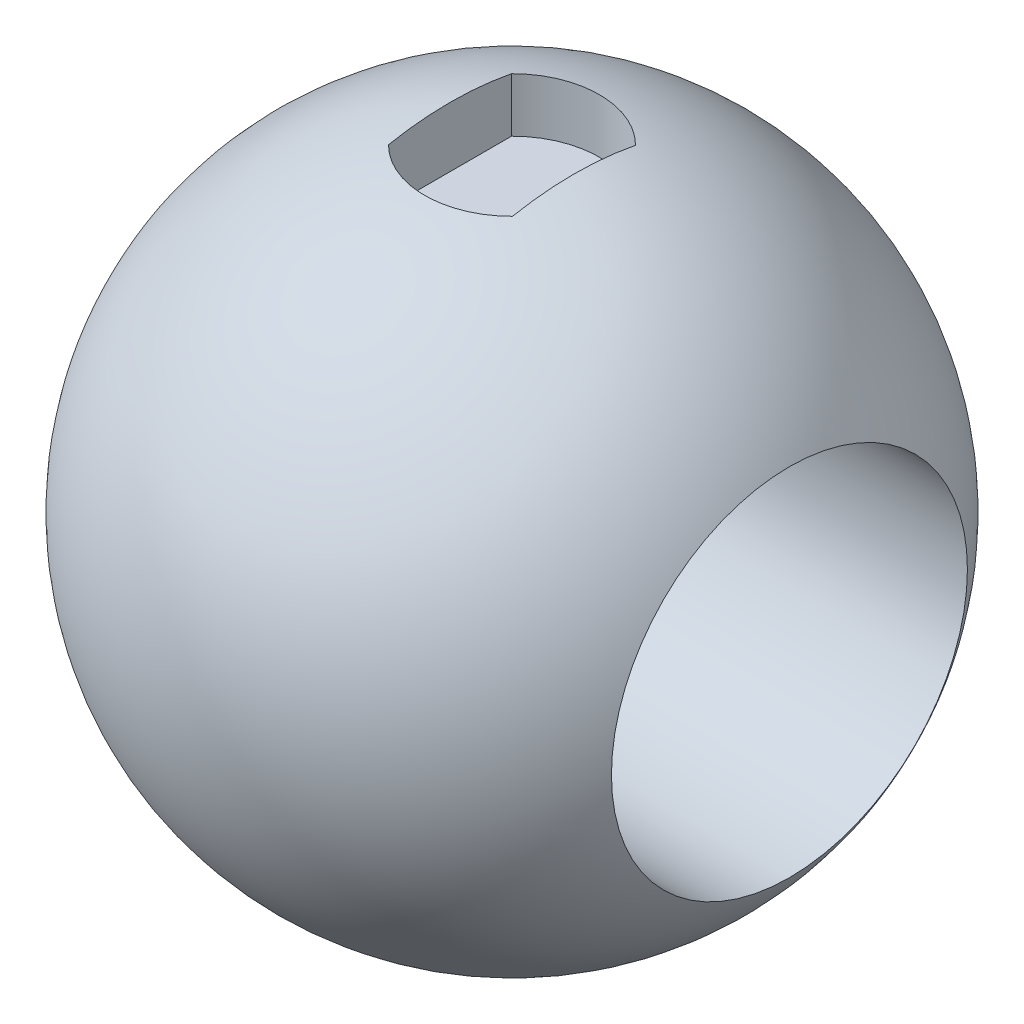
ISO-10303-21;
HEADER;
FILE_DESCRIPTION(('STEP AP214'),'2;1');
FILE_NAME('part.step','',(''),(''),'','','');
FILE_SCHEMA(('AUTOMOTIVE_DESIGN { 1 0 10303 214 1 1 1 1 }'));
ENDSEC;
DATA;
#1=APPLICATION_CONTEXT('core data for automotive mechanical design processes');
#2=APPLICATION_PROTOCOL_DEFINITION('international standard','automotive_design',2000,#1);
#3=PRODUCT_CONTEXT('',#1,'mechanical');
#4=PRODUCT('Part','Part','',(#3));
#5=PRODUCT_RELATED_PRODUCT_CATEGORY('part','',(#4));
#6=PRODUCT_DEFINITION_FORMATION('','',#4);
#7=PRODUCT_DEFINITION_CONTEXT('part definition',#1,'design');
#8=PRODUCT_DEFINITION('design','',#6,#7);
#9=PRODUCT_DEFINITION_SHAPE('','',#8);
#10=(LENGTH_UNIT() NAMED_UNIT(*) SI_UNIT(.MILLI.,.METRE.));
#11=(NAMED_UNIT(*) PLANE_ANGLE_UNIT() SI_UNIT($,.RADIAN.));
#12=(NAMED_UNIT(*) SI_UNIT($,.STERADIAN.) SOLID_ANGLE_UNIT());
#13=UNCERTAINTY_MEASURE_WITH_UNIT(LENGTH_MEASURE(1.E-05),#10,'distance_accuracy_value','');
#14=(GEOMETRIC_REPRESENTATION_CONTEXT(3) GLOBAL_UNCERTAINTY_ASSIGNED_CONTEXT((#13)) GLOBAL_UNIT_ASSIGNED_CONTEXT((#10,
#11,#12)) REPRESENTATION_CONTEXT('',''));
#15=CARTESIAN_POINT('',(0.,0.,0.));
#16=DIRECTION('',(0.,0.,1.));
#17=DIRECTION('',(1.,0.,0.));
#18=AXIS2_PLACEMENT_3D('',#15,#16,#17);
#19=CARTESIAN_POINT('',(0.,0.,0.));
#20=DIRECTION('',(-1.,0.,0.));
#21=DIRECTION('',(0.,1.,0.));
#22=AXIS2_PLACEMENT_3D('',#19,#20,#21);
#23=SPHERICAL_SURFACE('',#22,30.);
#24=CARTESIAN_POINT('',(-5.64291591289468,0.,0.));
#25=DIRECTION('',(-1.,0.,0.));
#26=DIRECTION('',(0.,0.,1.));
#27=AXIS2_PLACEMENT_3D('',#24,#25,#26);
#28=CIRCLE('',#27,29.4645125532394);
#29=CARTESIAN_POINT('',(-5.64291591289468,28.9274523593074,5.6));
#30=VERTEX_POINT('',#29);
#31=CARTESIAN_POINT('',(-5.64291591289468,28.9274523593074,-5.6));
#32=VERTEX_POINT('',#31);
#33=EDGE_CURVE('E104',#30,#32,#28,.T.);
#34=ORIENTED_EDGE('',*,*,#33,.T.);
#35=CARTESIAN_POINT('',(0.,28.9274523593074,0.));
#36=DIRECTION('',(0.,-1.,0.));
#37=DIRECTION('',(0.,0.,-1.));
#38=AXIS2_PLACEMENT_3D('',#35,#36,#37);
#39=CIRCLE('',#38,7.95);
#40=CARTESIAN_POINT('',(5.64291591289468,28.9274523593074,-5.6));
#41=VERTEX_POINT('',#40);
#42=EDGE_CURVE('E12',#32,#41,#39,.T.);
#43=ORIENTED_EDGE('',*,*,#42,.T.);
#44=CARTESIAN_POINT('',(5.64291591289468,0.,0.));
#45=DIRECTION('',(1.,0.,0.));
#46=DIRECTION('',(0.,0.,-1.));
#47=AXIS2_PLACEMENT_3D('',#44,#45,#46);
#48=CIRCLE('',#47,29.4645125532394);
#49=CARTESIAN_POINT('',(5.64291591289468,28.9274523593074,5.6));
#50=VERTEX_POINT('',#49);
#51=EDGE_CURVE('E40',#41,#50,#48,.T.);
#52=ORIENTED_EDGE('',*,*,#51,.T.);
#53=CARTESIAN_POINT('',(0.,28.9274523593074,0.));
#54=DIRECTION('',(0.,-1.,0.));
#55=DIRECTION('',(0.,0.,-1.));
#56=AXIS2_PLACEMENT_3D('',#53,#54,#55);
#57=CIRCLE('',#56,7.95);
#58=EDGE_CURVE('E108',#50,#30,#57,.T.);
#59=ORIENTED_EDGE('',*,*,#58,.T.);
#60=EDGE_LOOP('',(#34,#43,#52,#59));
#61=FACE_BOUND('',#60,.T.);
#62=CARTESIAN_POINT('',(25.25,0.,0.));
#63=DIRECTION('',(1.,0.,0.));
#64=DIRECTION('',(0.,1.,0.));
#65=AXIS2_PLACEMENT_3D('',#62,#63,#64);
#66=CIRCLE('',#65,16.1999228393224);
#67=CARTESIAN_POINT('',(25.25,16.1999228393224,0.));
#68=VERTEX_POINT('',#67);
#69=EDGE_CURVE('E97',#68,#68,#66,.T.);
#70=ORIENTED_EDGE('',*,*,#69,.F.);
#71=EDGE_LOOP('',(#70));
#72=FACE_BOUND('',#71,.T.);
#73=CARTESIAN_POINT('',(-25.25,0.,0.));
#74=DIRECTION('',(1.,0.,0.));
#75=DIRECTION('',(0.,1.,0.));
#76=AXIS2_PLACEMENT_3D('',#73,#74,#75);
#77=CIRCLE('',#76,16.1999228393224);
#78=CARTESIAN_POINT('',(-25.25,16.1999228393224,0.));
#79=VERTEX_POINT('',#78);
#80=EDGE_CURVE('E101',#79,#79,#77,.T.);
#81=ORIENTED_EDGE('',*,*,#80,.T.);
#82=EDGE_LOOP('',(#81));
#83=FACE_BOUND('',#82,.T.);
#84=ADVANCED_FACE('F33',(#61,#72,#83),#23,.T.);
#85=CARTESIAN_POINT('',(-25.25,0.,0.));
#86=DIRECTION('',(1.,0.,0.));
#87=DIRECTION('',(0.,1.,0.));
#88=AXIS2_PLACEMENT_3D('',#85,#86,#87);
#89=CYLINDRICAL_SURFACE('',#88,16.1999228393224);
#90=ORIENTED_EDGE('',*,*,#80,.F.);
#91=EDGE_LOOP('',(#90));
#92=FACE_BOUND('',#91,.T.);
#93=ORIENTED_EDGE('',*,*,#69,.T.);
#94=EDGE_LOOP('',(#93));
#95=FACE_BOUND('',#94,.T.);
#96=ADVANCED_FACE('F122',(#92,#95),#89,.F.);
#97=CARTESIAN_POINT('',(0.,24.,0.));
#98=DIRECTION('',(0.,1.,0.));
#99=DIRECTION('',(0.,0.,1.));
#100=AXIS2_PLACEMENT_3D('',#97,#98,#99);
#101=CYLINDRICAL_SURFACE('',#100,7.95);
#102=DIRECTION('',(0.,1.,0.));
#103=VECTOR('',#102,1.);
#104=CARTESIAN_POINT('',(-5.64291591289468,24.,-5.6));
#105=LINE('',#104,#103);
#106=CARTESIAN_POINT('',(-5.64291591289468,24.,-5.6));
#107=VERTEX_POINT('',#106);
#108=EDGE_CURVE('E47',#107,#32,#105,.T.);
#109=ORIENTED_EDGE('',*,*,#108,.F.);
#110=CARTESIAN_POINT('',(0.,24.,0.));
#111=DIRECTION('',(0.,1.,0.));
#112=DIRECTION('',(0.,0.,-1.));
#113=AXIS2_PLACEMENT_3D('',#110,#111,#112);
#114=CIRCLE('',#113,7.95);
#115=CARTESIAN_POINT('',(5.64291591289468,24.,-5.6));
#116=VERTEX_POINT('',#115);
#117=EDGE_CURVE('E74',#116,#107,#114,.T.);
#118=ORIENTED_EDGE('',*,*,#117,.F.);
#119=DIRECTION('',(0.,1.,0.));
#120=VECTOR('',#119,1.);
#121=CARTESIAN_POINT('',(5.64291591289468,24.,-5.6));
#122=LINE('',#121,#120);
#123=EDGE_CURVE('E95',#116,#41,#122,.T.);
#124=ORIENTED_EDGE('',*,*,#123,.T.);
#125=ORIENTED_EDGE('',*,*,#42,.F.);
#126=EDGE_LOOP('',(#109,#118,#124,#125));
#127=FACE_BOUND('',#126,.T.);
#128=ADVANCED_FACE('F72',(#127),#101,.F.);
#129=CARTESIAN_POINT('',(5.64291591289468,24.,5.6));
#130=DIRECTION('',(1.,0.,0.));
#131=DIRECTION('',(0.,0.,-1.));
#132=AXIS2_PLACEMENT_3D('',#129,#130,#131);
#133=PLANE('',#132);
#134=ORIENTED_EDGE('',*,*,#123,.F.);
#135=DIRECTION('',(0.,0.,-1.));
#136=VECTOR('',#135,1.);
#137=CARTESIAN_POINT('',(5.64291591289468,24.,5.6));
#138=LINE('',#137,#136);
#139=CARTESIAN_POINT('',(5.64291591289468,24.,5.6));
#140=VERTEX_POINT('',#139);
#141=EDGE_CURVE('E78',#140,#116,#138,.T.);
#142=ORIENTED_EDGE('',*,*,#141,.F.);
#143=DIRECTION('',(0.,1.,0.));
#144=VECTOR('',#143,1.);
#145=CARTESIAN_POINT('',(5.64291591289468,24.,5.6));
#146=LINE('',#145,#144);
#147=EDGE_CURVE('E98',#140,#50,#146,.T.);
#148=ORIENTED_EDGE('',*,*,#147,.T.);
#149=ORIENTED_EDGE('',*,*,#51,.F.);
#150=EDGE_LOOP('',(#134,#142,#148,#149));
#151=FACE_BOUND('',#150,.T.);
#152=ADVANCED_FACE('F114',(#151),#133,.F.);
#153=CARTESIAN_POINT('',(0.,24.,0.));
#154=DIRECTION('',(0.,1.,0.));
#155=DIRECTION('',(0.,0.,1.));
#156=AXIS2_PLACEMENT_3D('',#153,#154,#155);
#157=CYLINDRICAL_SURFACE('',#156,7.95);
#158=ORIENTED_EDGE('',*,*,#147,.F.);
#159=CARTESIAN_POINT('',(0.,24.,0.));
#160=DIRECTION('',(0.,1.,0.));
#161=DIRECTION('',(0.,0.,1.));
#162=AXIS2_PLACEMENT_3D('',#159,#160,#161);
#163=CIRCLE('',#162,7.95);
#164=CARTESIAN_POINT('',(-5.64291591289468,24.,5.6));
#165=VERTEX_POINT('',#164);
#166=EDGE_CURVE('E87',#165,#140,#163,.T.);
#167=ORIENTED_EDGE('',*,*,#166,.F.);
#168=DIRECTION('',(0.,1.,0.));
#169=VECTOR('',#168,1.);
#170=CARTESIAN_POINT('',(-5.64291591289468,24.,5.6));
#171=LINE('',#170,#169);
#172=EDGE_CURVE('E77',#165,#30,#171,.T.);
#173=ORIENTED_EDGE('',*,*,#172,.T.);
#174=ORIENTED_EDGE('',*,*,#58,.F.);
#175=EDGE_LOOP('',(#158,#167,#173,#174));
#176=FACE_BOUND('',#175,.T.);
#177=ADVANCED_FACE('F113',(#176),#157,.F.);
#178=CARTESIAN_POINT('',(-5.64291591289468,24.,5.6));
#179=DIRECTION('',(-1.,0.,0.));
#180=DIRECTION('',(0.,0.,1.));
#181=AXIS2_PLACEMENT_3D('',#178,#179,#180);
#182=PLANE('',#181);
#183=ORIENTED_EDGE('',*,*,#172,.F.);
#184=DIRECTION('',(0.,0.,1.));
#185=VECTOR('',#184,1.);
#186=CARTESIAN_POINT('',(-5.64291591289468,24.,5.6));
#187=LINE('',#186,#185);
#188=EDGE_CURVE('E81',#107,#165,#187,.T.);
#189=ORIENTED_EDGE('',*,*,#188,.F.);
#190=ORIENTED_EDGE('',*,*,#108,.T.);
#191=ORIENTED_EDGE('',*,*,#33,.F.);
#192=EDGE_LOOP('',(#183,#189,#190,#191));
#193=FACE_BOUND('',#192,.T.);
#194=ADVANCED_FACE('F82',(#193),#182,.F.);
#195=CARTESIAN_POINT('',(0.,24.,0.));
#196=DIRECTION('',(0.,-1.,0.));
#197=DIRECTION('',(0.,0.,-1.));
#198=AXIS2_PLACEMENT_3D('',#195,#196,#197);
#199=PLANE('',#198);
#200=ORIENTED_EDGE('',*,*,#117,.T.);
#201=ORIENTED_EDGE('',*,*,#188,.T.);
#202=ORIENTED_EDGE('',*,*,#166,.T.);
#203=ORIENTED_EDGE('',*,*,#141,.T.);
#204=EDGE_LOOP('',(#200,#201,#202,#203));
#205=FACE_BOUND('',#204,.T.);
#206=ADVANCED_FACE('F89',(#205),#199,.F.);
#207=CLOSED_SHELL('',(#84,#96,#128,#152,#177,#194,#206));
#208=MANIFOLD_SOLID_BREP('B2',#207);
#209=ADVANCED_BREP_SHAPE_REPRESENTATION('',(#18,#208),#14);
#210=SHAPE_DEFINITION_REPRESENTATION(#9,#209);
ENDSEC;
END-ISO-10303-21;
